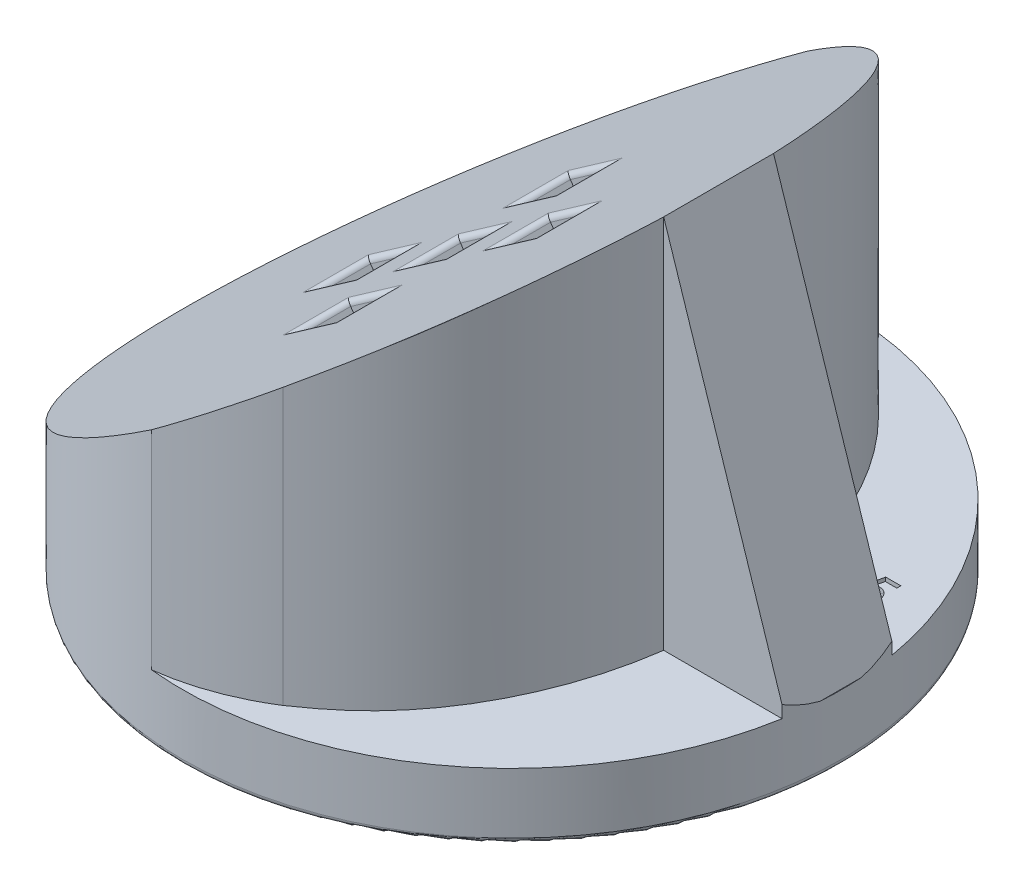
from build123d import *

# Parameters (mm, degrees)
SKETCH1_R           = 30
BOSS_EXTRUDE1_DEPTH = 50
SKETCH4_W           = 5
SKETCH4_H           = 5
CUT_EXTRUDE2_DEPTH  = 3
FILLET2_R           = 0.5
CUT_EXTRUDE10_DEPTH = 45
SKETCH15_W          = 5
SKETCH15_H          = 5
CUT_EXTRUDE11_DEPTH = 3
CUT_EXTRUDE13_DEPTH = 100
FILLET8_R           = 0.5
FILLET9_R           = 0.5
FILLET10_R          = 0.5
FILLET11_R          = 0.5
FILLET12_R          = 0.5
CUT_EXTRUDE14_DEPTH = 50
CUT_EXTRUDE15_DEPTH = 25
CUT_EXTRUDE16_DEPTH = 2


with BuildPart() as part:
    # Sketch1 → Boss-Extrude1 (new body)
    with BuildSketch(Plane(origin=(0, 0, 0), x_dir=(1, 0, 0), z_dir=(0, 1, 0))):
        with Locations(Location((0, 0, 0), (0, 0, 270))):
            Circle(SKETCH1_R)
    extrude(amount=BOSS_EXTRUDE1_DEPTH)

    # Sketch4 → Cut-Extrude2 (cut)
    with BuildSketch(Plane(origin=(0, 0, 0), x_dir=(-1, 0, 0), z_dir=(0, -1, 0))):
        Rectangle(SKETCH4_W, SKETCH4_H)
        with Locations((0, -10)):
            Rectangle(SKETCH4_W, SKETCH4_H)
        with Locations((10, 0)):
            Rectangle(SKETCH4_W, SKETCH4_H)
        with Locations((-10, 0)):
            Rectangle(SKETCH4_W, SKETCH4_H)
        with Locations((0, 10)):
            Rectangle(SKETCH4_W, SKETCH4_H)
    extrude(amount=-CUT_EXTRUDE2_DEPTH, mode=Mode.SUBTRACT)

    # Fillet2
    fillet2_edges = [part.edges().sort_by_distance(p)[0] for p in [
        (0, 0, -30),
        (-2.5, 0, 10),
        (0, 0, 7.5),
        (2.5, 0, 10),
        (0, 0, 12.5),
        (-12.5, 0, 0),
        (-10, 0, -2.5),
        (-7.5, 0, 0),
        (-10, 0, 2.5),
        (7.5, 0, 0),
        (10, 0, -2.5),
        (12.5, 0, 0),
        (10, 0, 2.5),
        (2.5, 0, -10),
        (0, 0, -7.5),
        (-2.5, 0, -10),
        (0, 0, -12.5),
        (-2.5, 0, 0),
        (0, 0, -2.5),
        (2.5, 0, 0),
        (0, 0, 2.5),
    ]]
    fillet(fillet2_edges, radius=FILLET2_R)

    # Sketch13 → Cut-Extrude10 (cut, symmetric)
    with BuildSketch(Plane.XY.offset(3.5)):
        Polygon((-30, 6), (30, 48.012452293), (30, 50), (-30, 50), align=None)
    extrude(amount=CUT_EXTRUDE10_DEPTH, both=True, mode=Mode.SUBTRACT)

    # Sketch15 → Cut-Extrude11 (cut)
    with BuildSketch(Plane(origin=(-12.688775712, 18.121449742, 0), x_dir=(0.8191520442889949, 0.5735764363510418, 0), z_dir=(-0.5735764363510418, 0.8191520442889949, 0))):
        with Locations((-1.133102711, 0)):
            Rectangle(SKETCH15_W, SKETCH15_H)
        with Locations((8.866897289, 0)):
            Rectangle(SKETCH15_W, SKETCH15_H)
        with Locations((18.866897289, 0)):
            Rectangle(SKETCH15_W, SKETCH15_H)
        with Locations((8.866897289, -10)):
            Rectangle(SKETCH15_W, SKETCH15_H)
        with Locations((8.866897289, 10)):
            Rectangle(SKETCH15_W, SKETCH15_H)
    extrude(amount=-CUT_EXTRUDE11_DEPTH, mode=Mode.SUBTRACT)

    # Sketch24 → Cut-Extrude13 (cut)
    with BuildSketch(Plane(origin=(-12.688775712, 18.121449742, 0), x_dir=(0.8191520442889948, 0.5735764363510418, 0), z_dir=(-0.5735764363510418, 0.8191520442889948, 0))):
        with BuildLine():
            ThreePointArc((11.849297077, 29.85138676), (38.866897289, 0), (11.849297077, -29.85138676))
            add(Edge.make_bspline(
                [(15.490134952, -30), (13.665195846, -30), (11.849297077, -29.85138676)],
                knots=[4.71238898, 4.71238898, 4.71238898, 4.820845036, 4.820845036, 4.820845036], degree=2, weights=[1, 0.979777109, 0.962346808]))
            add(Edge.make_bspline(
                [(52.113372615, 0), (52.113372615, -30), (15.490134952, -30)],
                knots=[3.141592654, 3.141592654, 3.141592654, 4.71238898, 4.71238898, 4.71238898], degree=2, weights=[1, 0.707106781, 1]))
            add(Edge.make_bspline(
                [(11.849297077, 29.85138676), (13.665195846, 30), (15.490134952, 30), (52.113372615, 30), (52.113372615, 0)],
                knots=[1.462340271, 1.462340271, 1.462340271, 1.570796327, 1.570796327, 3.141592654, 3.141592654, 3.141592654], degree=2, weights=[0.962346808, 0.979777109, 1, 0.707106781, 1]))
        make_face()
    extrude(amount=-CUT_EXTRUDE13_DEPTH, mode=Mode.SUBTRACT)

    # Fillet8
    fillet8_edges = [part.edges().sort_by_distance(p)[0] for p in [
        (-7.473318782, 21.773352, -10),
        (-5.425438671, 23.207293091, -7.5),
        (-3.377558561, 24.641234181, -10),
        (-5.425438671, 23.207293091, -12.5),
    ]]
    fillet(fillet8_edges, radius=FILLET8_R)

    # Fillet9
    fillet9_edges = [part.edges().sort_by_distance(p)[0] for p in [
        (0.718201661, 27.509116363, 0),
        (2.766081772, 28.943057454, 2.5),
        (4.813961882, 30.376998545, 0),
        (2.766081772, 28.943057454, -2.5),
    ]]
    fillet(fillet9_edges, radius=FILLET9_R)

    # Fillet10
    fillet10_edges = [part.edges().sort_by_distance(p)[0] for p in [
        (-15.664839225, 16.037587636, 0),
        (-13.616959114, 17.471528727, 2.5),
        (-11.569079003, 18.905469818, 0),
        (-13.616959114, 17.471528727, -2.5),
    ]]
    fillet(fillet10_edges, radius=FILLET10_R)

    # Fillet11
    fillet11_edges = [part.edges().sort_by_distance(p)[0] for p in [
        (-7.473318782, 21.773352, 10),
        (-5.425438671, 23.207293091, 12.5),
        (-3.377558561, 24.641234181, 10),
        (-5.425438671, 23.207293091, 7.5),
    ]]
    fillet(fillet11_edges, radius=FILLET11_R)

    # Fillet12
    fillet12_edges = [part.edges().sort_by_distance(p)[0] for p in [
        (-7.473318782, 21.773352, 0),
        (-5.425438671, 23.207293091, 2.5),
        (-3.377558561, 24.641234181, 0),
        (-5.425438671, 23.207293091, -2.5),
    ]]
    fillet(fillet12_edges, radius=FILLET12_R)

    # Sketch25 → Cut-Extrude14 (cut)
    with BuildSketch(Plane(origin=(0, 6, 0), x_dir=(-1, 0, 0), z_dir=(0, -1, 0))):
        with BuildLine():
            Line((2.982399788, 29.85138676), (2.982399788, 40.435648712))
            Line((2.982399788, 40.435648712), (-36.507779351, 40.435648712))
            Line((-36.507779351, 40.435648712), (-36.507779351, 5))
            Line((-36.507779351, 5), (-18.805401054, 5))
            add(Edge.make_bspline(
                [(2.982399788, 29.85138676), (-0.1335977, 29.479810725), (-4.811367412, 27.726430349), (-10.418915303, 23.261006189), (-14.5569191, 18.037049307), (-17.471507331, 11.668635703), (-18.519245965, 7.066793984), (-18.805401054, 5)],
                knots=[0, 0, 0, 0, 0.114663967, 0.178838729, 0.260998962, 0.356747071, 0.433182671, 0.433182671, 0.433182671, 0.433182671], degree=3))
        make_face()
        with BuildLine():
            Line((2.982399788, -29.85138676), (2.982399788, -34.082141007))
            Line((2.982399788, -34.082141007), (-36.507779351, -34.082141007))
            Line((-36.507779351, -34.082141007), (-36.507779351, -5))
            Line((-36.507779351, -5), (-18.805379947, -5))
            add(Edge.make_bspline(
                [(-18.805379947, -5), (-18.601490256, -6.472779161), (-17.82498983, -10.318933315), (-15.470969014, -16.436630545), (-11.319416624, -22.480484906), (-7.65136063, -25.446079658), (-5.814668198, -26.678018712)],
                knots=[0.555654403, 0.555654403, 0.555654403, 0.555654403, 0.610075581, 0.699017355, 0.794823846, 0.873695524, 0.873695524, 0.873695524, 0.873695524], degree=3))
            add(Edge.make_bspline(
                [(-5.814668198, -26.678018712), (-3.161395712, -28.351751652), (-0.134628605, -29.474071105), (2.982399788, -29.85138676)],
                knots=[0, 0, 0, 0, 1, 1, 1, 1], degree=3))
        make_face()
    extrude(amount=-CUT_EXTRUDE14_DEPTH, mode=Mode.SUBTRACT)

    # Sketch26 → Cut-Extrude15 (cut, symmetric)
    with BuildSketch(Plane.XY.offset(3.5)):
        Polygon((18.805392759, 40.173903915), (29.940920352, 6), (32.460221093, 6), (31.200570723, 39.613324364), align=None)
    extrude(amount=CUT_EXTRUDE15_DEPTH, both=True, mode=Mode.SUBTRACT)


with BuildPart() as cut_extrude15_kept_piece:
    # of the separate pieces the step leaves, the one the design keeps (cut_extrude15_pieces_kept)
    add(part.part.solids().sort_by_distance((-2.982399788, 24.917927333, 29.85138676))[0])

    # Sketch27 → Cut-Extrude16 (cut)
    with BuildSketch(Plane(origin=(0, 6, 0), x_dir=(1, 0, 0), z_dir=(0, 1, 0))):
        with BuildLine():
            Line((20.462246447, 10.109310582), (20.071731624, 10.109310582))
            add(Edge.make_bspline(
                [(20.071731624, 10.109310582), (20.079693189, 10.144428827), (20.095277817, 10.213172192), (20.126781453, 10.311374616), (20.162278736, 10.403213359), (20.203289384, 10.487986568), (20.250812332, 10.565033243), (20.302258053, 10.635840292), (20.359835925, 10.698931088), (20.422281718, 10.755178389), (20.489280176, 10.803767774), (20.558848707, 10.846871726), (20.631541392, 10.883011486), (20.706900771, 10.91329117), (20.78531392, 10.936209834), (20.86671575, 10.951690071), (20.950628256, 10.962564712), (21.007701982, 10.963596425), (21.036570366, 10.964118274)],
                knots=[0, 0, 0, 0, 1.225194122, 2.398296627, 3.506547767, 4.574817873, 5.598350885, 6.584148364, 7.54966307, 8.500147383, 9.439776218, 10.36307994, 11.282851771, 12.199447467, 13.124300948, 14.058371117, 15.017907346, 16, 16, 16, 16], degree=3))
            add(Edge.make_bspline(
                [(21.036570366, 10.964118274), (21.081389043, 10.962608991), (21.170101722, 10.959621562), (21.300787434, 10.937048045), (21.42634095, 10.898299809), (21.545594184, 10.845920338), (21.655796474, 10.781786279), (21.753262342, 10.706965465), (21.837084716, 10.623317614), (21.904840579, 10.530743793), (21.958494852, 10.43360266), (21.996830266, 10.333879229), (22.021208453, 10.232592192), (22.024123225, 10.164352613), (22.025577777, 10.130299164)],
                knots=[0, 0, 0, 0, 1.126551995, 2.229861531, 3.322496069, 4.422827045, 5.497949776, 6.520418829, 7.504194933, 8.464779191, 9.395175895, 10.286118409, 11.144725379, 12, 12, 12, 12], degree=3))
            add(Edge.make_bspline(
                [(22.025577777, 10.130299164), (22.024537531, 10.09735811), (22.022502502, 10.032915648), (22.004807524, 9.939235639), (21.976354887, 9.851354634), (21.935652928, 9.76963744), (21.883782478, 9.693920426), (21.819787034, 9.62485752), (21.744930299, 9.56119016), (21.688335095, 9.525404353), (21.659231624, 9.507001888)],
                knots=[0, 0, 0, 0, 1.039530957, 2.033630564, 2.999111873, 3.948297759, 4.906578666, 5.887513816, 6.913676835, 8, 8, 8, 8], degree=3))
            add(Edge.make_bspline(
                [(21.659231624, 9.507001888), (21.690679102, 9.49352814), (21.753428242, 9.466643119), (21.838838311, 9.409326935), (21.917353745, 9.340924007), (21.961258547, 9.286599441), (21.983600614, 9.258955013)],
                knots=[0, 0, 0, 0, 0.990740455, 1.976887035, 2.970487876, 4, 4, 4, 4], degree=3))
            add(Edge.make_bspline(
                [(21.983600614, 9.258955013), (21.999790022, 9.236471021), (22.031767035, 9.192061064), (22.074186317, 9.122697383), (22.108667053, 9.051169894), (22.138629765, 8.979283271), (22.160757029, 8.90569249), (22.176701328, 8.831040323), (22.186587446, 8.755070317), (22.187792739, 8.703952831), (22.18839829, 8.678270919)],
                knots=[0, 0, 0, 0, 1.060434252, 2.094549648, 3.107169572, 4.097295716, 5.072846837, 6.043796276, 7.017184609, 8, 8, 8, 8], degree=3))
            add(Edge.make_bspline(
                [(22.18839829, 8.678270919), (22.186800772, 8.63401719), (22.183596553, 8.54525539), (22.153724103, 8.413828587), (22.107980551, 8.284361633), (22.054428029, 8.180596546), (22.004008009, 8.100134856), (21.961488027, 8.042707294), (21.915713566, 7.988198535), (21.865481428, 7.937901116), (21.812386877, 7.890006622), (21.754732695, 7.846124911), (21.693536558, 7.805379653), (21.629094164, 7.76791597), (21.561325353, 7.735018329), (21.491700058, 7.705431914), (21.41937789, 7.681706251), (21.345709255, 7.660802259), (21.269465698, 7.646025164), (21.191439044, 7.634151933), (21.111079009, 7.628093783), (21.056930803, 7.626900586), (21.029574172, 7.626297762)],
                knots=[0, 0, 0, 0, 1.521749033, 3.052244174, 4.617626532, 6.240122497, 7.060311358, 7.885196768, 8.698339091, 9.508724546, 10.330730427, 11.158549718, 12.000758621, 12.860902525, 13.722748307, 14.593084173, 15.463328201, 16.341708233, 17.227848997, 18.135261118, 19.057900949, 20, 20, 20, 20], degree=3))
            add(Edge.make_bspline(
                [(21.029574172, 7.626297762), (20.994990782, 7.627069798), (20.926924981, 7.628589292), (20.827127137, 7.639385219), (20.731573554, 7.65783173), (20.640569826, 7.68402839), (20.553522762, 7.716960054), (20.471289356, 7.757989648), (20.393195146, 7.805820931), (20.319630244, 7.861316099), (20.25159309, 7.925004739), (20.189174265, 7.996786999), (20.134045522, 8.07761631), (20.08421242, 8.166252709), (20.041037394, 8.263708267), (20.003793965, 8.369198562), (19.972208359, 8.483067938), (19.95729456, 8.562384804), (19.949616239, 8.603220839)],
                knots=[0, 0, 0, 0, 1.031951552, 2.031050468, 2.99141865, 3.932589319, 4.853771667, 5.764839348, 6.670884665, 7.583203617, 8.509779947, 9.447179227, 10.415909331, 11.424319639, 12.477825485, 13.592421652, 14.760465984, 16, 16, 16, 16], degree=3))
            Line((19.949616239, 8.603220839), (20.344583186, 8.603220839))
            add(Edge.make_bspline(
                [(20.344583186, 8.603220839), (20.352455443, 8.576240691), (20.367538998, 8.524545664), (20.392266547, 8.450715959), (20.418867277, 8.384371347), (20.446276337, 8.324620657), (20.474631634, 8.271704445), (20.504547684, 8.225708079), (20.535409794, 8.186201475), (20.558645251, 8.164532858), (20.569733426, 8.154192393)],
                knots=[0, 0, 0, 0, 1.326285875, 2.54121601, 3.672658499, 4.697761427, 5.642367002, 6.502616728, 7.285434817, 8, 8, 8, 8], degree=3))
            add(Edge.make_bspline(
                [(20.569733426, 8.154192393), (20.585783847, 8.141090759), (20.617572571, 8.115142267), (20.669919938, 8.083055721), (20.723902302, 8.054330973), (20.781448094, 8.032716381), (20.840811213, 8.014446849), (20.903000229, 8.001848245), (20.967681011, 7.994073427), (21.011743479, 7.993124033), (21.034026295, 7.992643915)],
                knots=[0, 0, 0, 0, 0.989076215, 1.958918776, 2.928708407, 3.907140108, 4.891221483, 5.894723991, 6.935341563, 8, 8, 8, 8], degree=3))
            add(Edge.make_bspline(
                [(21.034026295, 7.992643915), (21.061608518, 7.99329509), (21.115647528, 7.994570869), (21.194439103, 8.00333576), (21.269149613, 8.01875366), (21.339450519, 8.040188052), (21.405807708, 8.067716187), (21.467526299, 8.101557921), (21.525337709, 8.141093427), (21.577819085, 8.186970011), (21.62484048, 8.236759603), (21.666771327, 8.288707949), (21.702602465, 8.342559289), (21.731307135, 8.399006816), (21.753923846, 8.457355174), (21.769582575, 8.517766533), (21.779620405, 8.580201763), (21.780765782, 8.622474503), (21.781347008, 8.643925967)],
                knots=[0, 0, 0, 0, 1.196856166, 2.344877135, 3.434653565, 4.502660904, 5.529498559, 6.546397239, 7.551828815, 8.562675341, 9.564818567, 10.520268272, 11.456705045, 12.365995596, 13.262962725, 14.166698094, 15.069683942, 16, 16, 16, 16], degree=3))
            add(Edge.make_bspline(
                [(21.781347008, 8.643925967), (21.780081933, 8.672222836), (21.77755349, 8.728778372), (21.75836248, 8.811939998), (21.727582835, 8.892590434), (21.684104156, 8.968842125), (21.631183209, 9.04027629), (21.567708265, 9.102847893), (21.495336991, 9.156308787), (21.427831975, 9.193269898), (21.366665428, 9.217695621), (21.313327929, 9.234690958), (21.252757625, 9.249786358), (21.185237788, 9.263010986), (21.110540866, 9.27438915), (21.028642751, 9.283782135), (20.939328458, 9.291276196), (20.877362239, 9.295117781), (20.845129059, 9.297116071)],
                knots=[0, 0, 0, 0, 1.058801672, 2.116173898, 3.179133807, 4.280986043, 5.392377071, 6.498225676, 7.604871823, 8.752253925, 9.368447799, 10.068883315, 10.846735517, 11.704571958, 12.644304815, 13.675272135, 14.790738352, 16, 16, 16, 16], degree=3))
            Line((20.845129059, 9.297116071), (20.845129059, 9.661554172))
            add(Edge.make_bspline(
                [(20.845129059, 9.661554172), (20.887145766, 9.662327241), (20.967805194, 9.663811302), (21.083604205, 9.677299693), (21.188992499, 9.699017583), (21.28345852, 9.73004704), (21.365858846, 9.768450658), (21.437337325, 9.809657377), (21.49571115, 9.856648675), (21.541693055, 9.907898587), (21.575492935, 9.963125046), (21.601116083, 10.019718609), (21.615307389, 10.07958296), (21.617446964, 10.120055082), (21.618526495, 10.140475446)],
                knots=[0, 0, 0, 0, 1.49683591, 2.87347434, 4.147795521, 5.325633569, 6.407353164, 7.383009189, 8.25851615, 9.066624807, 9.823413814, 10.557538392, 11.272200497, 12, 12, 12, 12], degree=3))
            add(Edge.make_bspline(
                [(21.618526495, 10.140475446), (21.618063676, 10.155563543), (21.617151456, 10.185302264), (21.609055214, 10.229253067), (21.596511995, 10.271790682), (21.578573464, 10.312831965), (21.555075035, 10.352006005), (21.527298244, 10.390205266), (21.493725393, 10.426556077), (21.455831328, 10.461197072), (21.414358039, 10.493450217), (21.369486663, 10.521726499), (21.321673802, 10.545215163), (21.270915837, 10.564310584), (21.217566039, 10.579638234), (21.161163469, 10.590389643), (21.102021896, 10.596859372), (21.061603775, 10.597464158), (21.041022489, 10.597772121)],
                knots=[0, 0, 0, 0, 0.88508993, 1.744517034, 2.61478088, 3.484243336, 4.365825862, 5.291885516, 6.252189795, 7.265246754, 8.303377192, 9.332440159, 10.373327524, 11.425096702, 12.51242353, 13.62794981, 14.792129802, 16, 16, 16, 16], degree=3))
            add(Edge.make_bspline(
                [(21.041022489, 10.597772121), (21.011469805, 10.596493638), (20.953716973, 10.593995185), (20.869779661, 10.576051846), (20.791851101, 10.544825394), (20.73108623, 10.509244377), (20.685435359, 10.473165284), (20.651913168, 10.439290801), (20.619330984, 10.399051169), (20.586115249, 10.353507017), (20.554262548, 10.301171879), (20.522772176, 10.242950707), (20.491402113, 10.178507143), (20.472203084, 10.132941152), (20.462246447, 10.109310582)],
                knots=[0, 0, 0, 0, 1.30644707, 2.553102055, 3.773430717, 5.004978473, 5.652102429, 6.34150733, 7.107309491, 7.939915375, 8.832283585, 9.813897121, 10.866284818, 12, 12, 12, 12], degree=3))
        make_face()
        with BuildLine():
            Line((24.508590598, 10.882708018), (24.508590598, 10.516361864))
            Line((24.508590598, 10.516361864), (23.465521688, 10.516361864))
            Line((23.465521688, 10.516361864), (23.295068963, 9.76395301))
            add(Edge.make_bspline(
                [(23.295068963, 9.76395301), (23.31495441, 9.773536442), (23.355878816, 9.793259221), (23.424298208, 9.810443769), (23.49858218, 9.822534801), (23.550477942, 9.823745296), (23.57746079, 9.824374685)],
                knots=[0, 0, 0, 0, 0.906577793, 1.865744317, 2.890308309, 4, 4, 4, 4], degree=3))
            add(Edge.make_bspline(
                [(23.57746079, 9.824374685), (23.615676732, 9.823674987), (23.690707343, 9.822301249), (23.800058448, 9.80695023), (23.904259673, 9.783952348), (24.002453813, 9.749643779), (24.095762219, 9.707408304), (24.183172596, 9.654556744), (24.264594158, 9.591985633), (24.339918, 9.520760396), (24.408569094, 9.443179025), (24.467531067, 9.359398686), (24.51864105, 9.271866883), (24.559153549, 9.179070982), (24.591162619, 9.081970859), (24.613926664, 8.980160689), (24.628398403, 8.87394552), (24.629929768, 8.80149359), (24.630705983, 8.764769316)],
                knots=[0, 0, 0, 0, 1.094894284, 2.149641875, 3.159658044, 4.149576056, 5.125966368, 6.091225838, 7.071072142, 8.064343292, 9.05924964, 10.03573454, 10.996966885, 11.96032995, 12.932910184, 13.923798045, 14.947619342, 16, 16, 16, 16], degree=3))
            add(Edge.make_bspline(
                [(24.630705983, 8.764769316), (24.630109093, 8.739107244), (24.628928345, 8.688343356), (24.622775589, 8.612860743), (24.611031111, 8.53900633), (24.595437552, 8.466209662), (24.573950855, 8.395094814), (24.549490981, 8.324716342), (24.519440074, 8.256196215), (24.485132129, 8.189562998), (24.447067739, 8.125304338), (24.40515708, 8.064199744), (24.359304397, 8.006737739), (24.309346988, 7.953399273), (24.256650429, 7.902812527), (24.199840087, 7.856297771), (24.139077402, 7.813659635), (24.075229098, 7.774432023), (24.008325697, 7.738992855), (23.937974, 7.709649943), (23.865920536, 7.682989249), (23.790383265, 7.663026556), (23.712786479, 7.646228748), (23.632198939, 7.63508119), (23.549185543, 7.62781324), (23.492886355, 7.626808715), (23.464249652, 7.626297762)],
                knots=[0, 0, 0, 0, 1.012275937, 2.002451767, 2.98397589, 3.959820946, 4.936095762, 5.911940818, 6.896771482, 7.884012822, 8.866284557, 9.840372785, 10.804070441, 11.762530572, 12.720625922, 13.68308951, 14.655094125, 15.646011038, 16.637104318, 17.63729087, 18.650257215, 19.66446511, 20.715636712, 21.77986274, 22.870722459, 24, 24, 24, 24], degree=3))
            add(Edge.make_bspline(
                [(23.464249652, 7.626297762), (23.431996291, 7.627072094), (23.368367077, 7.628599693), (23.274914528, 7.639434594), (23.185262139, 7.657818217), (23.099789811, 7.684134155), (23.017861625, 7.717141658), (22.94017607, 7.757973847), (22.866431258, 7.806264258), (22.796532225, 7.861092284), (22.732781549, 7.923636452), (22.674017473, 7.990967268), (22.623949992, 8.065563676), (22.579905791, 8.145367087), (22.542062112, 8.231026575), (22.511955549, 8.322704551), (22.487881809, 8.420053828), (22.478259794, 8.487357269), (22.473334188, 8.521810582)],
                knots=[0, 0, 0, 0, 1.049569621, 2.070583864, 3.057046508, 4.023914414, 4.977170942, 5.927726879, 6.875021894, 7.842677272, 8.813672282, 9.777581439, 10.74592533, 11.731059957, 12.74126976, 13.788569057, 14.867946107, 16, 16, 16, 16], degree=3))
            Line((22.473334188, 8.521810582), (22.870845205, 8.521810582))
            add(Edge.make_bspline(
                [(22.870845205, 8.521810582), (22.878410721, 8.488536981), (22.892612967, 8.426074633), (22.923123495, 8.340965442), (22.955824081, 8.26857938), (22.995819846, 8.209380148), (23.041724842, 8.160786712), (23.092676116, 8.118606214), (23.148652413, 8.080769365), (23.210276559, 8.049361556), (23.275204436, 8.023916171), (23.342666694, 8.006156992), (23.411300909, 7.99499012), (23.457636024, 7.99342559), (23.480786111, 7.992643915)],
                knots=[0, 0, 0, 0, 1.385459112, 2.600831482, 3.66841355, 4.605180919, 5.48910649, 6.376050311, 7.288896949, 8.229144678, 9.181161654, 10.117453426, 11.059436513, 12, 12, 12, 12], degree=3))
            add(Edge.make_bspline(
                [(23.480786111, 7.992643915), (23.505829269, 7.993484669), (23.555272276, 7.995144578), (23.628109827, 8.005081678), (23.69776959, 8.023462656), (23.76525732, 8.047287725), (23.829394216, 8.07973846), (23.89175457, 8.117628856), (23.950064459, 8.1641572), (24.005953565, 8.215891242), (24.057142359, 8.273194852), (24.101715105, 8.33510887), (24.139737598, 8.40039004), (24.170038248, 8.469472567), (24.194629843, 8.541723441), (24.211533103, 8.617636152), (24.222079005, 8.697052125), (24.223122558, 8.751166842), (24.2236547, 8.778761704)],
                knots=[0, 0, 0, 0, 0.99750234, 1.969380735, 2.919490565, 3.862219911, 4.813679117, 5.776605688, 6.762898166, 7.778387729, 8.806918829, 9.816812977, 10.811632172, 11.809420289, 12.815921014, 13.846113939, 14.901663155, 16, 16, 16, 16], degree=3))
            add(Edge.make_bspline(
                [(24.2236547, 8.778761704), (24.223021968, 8.803382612), (24.221779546, 8.851727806), (24.212678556, 8.922385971), (24.198242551, 8.989785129), (24.177265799, 9.053291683), (24.150300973, 9.113257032), (24.117142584, 9.169297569), (24.077891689, 9.22172537), (24.033750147, 9.270710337), (23.983780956, 9.314478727), (23.930128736, 9.353650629), (23.871164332, 9.385331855), (23.80901424, 9.412442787), (23.742240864, 9.432256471), (23.672040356, 9.448221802), (23.597133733, 9.455892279), (23.545884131, 9.45730403), (23.519583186, 9.458028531)],
                knots=[0, 0, 0, 0, 1.071512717, 2.104004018, 3.095982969, 4.067795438, 5.009520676, 5.952827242, 6.895998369, 7.856350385, 8.817411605, 9.782937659, 10.74115891, 11.725120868, 12.729302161, 13.768330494, 14.854722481, 16, 16, 16, 16], degree=3))
            add(Edge.make_bspline(
                [(23.519583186, 9.458028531), (23.497092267, 9.457488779), (23.449874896, 9.456355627), (23.375988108, 9.448162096), (23.295584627, 9.435274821), (23.208791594, 9.417451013), (23.115525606, 9.394230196), (23.01567333, 9.366092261), (22.909124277, 9.333258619), (22.836428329, 9.308146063), (22.798975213, 9.295208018)],
                knots=[0, 0, 0, 0, 0.727614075, 1.527550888, 2.402655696, 3.361819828, 4.39328773, 5.511706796, 6.718025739, 8, 8, 8, 8], degree=3))
            Line((22.798975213, 9.295208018), (23.13224845, 10.882708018))
            Line((23.13224845, 10.882708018), (24.508590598, 10.882708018))
        make_face()
    extrude(amount=-CUT_EXTRUDE16_DEPTH, mode=Mode.SUBTRACT)


solid = cut_extrude15_kept_piece.part
